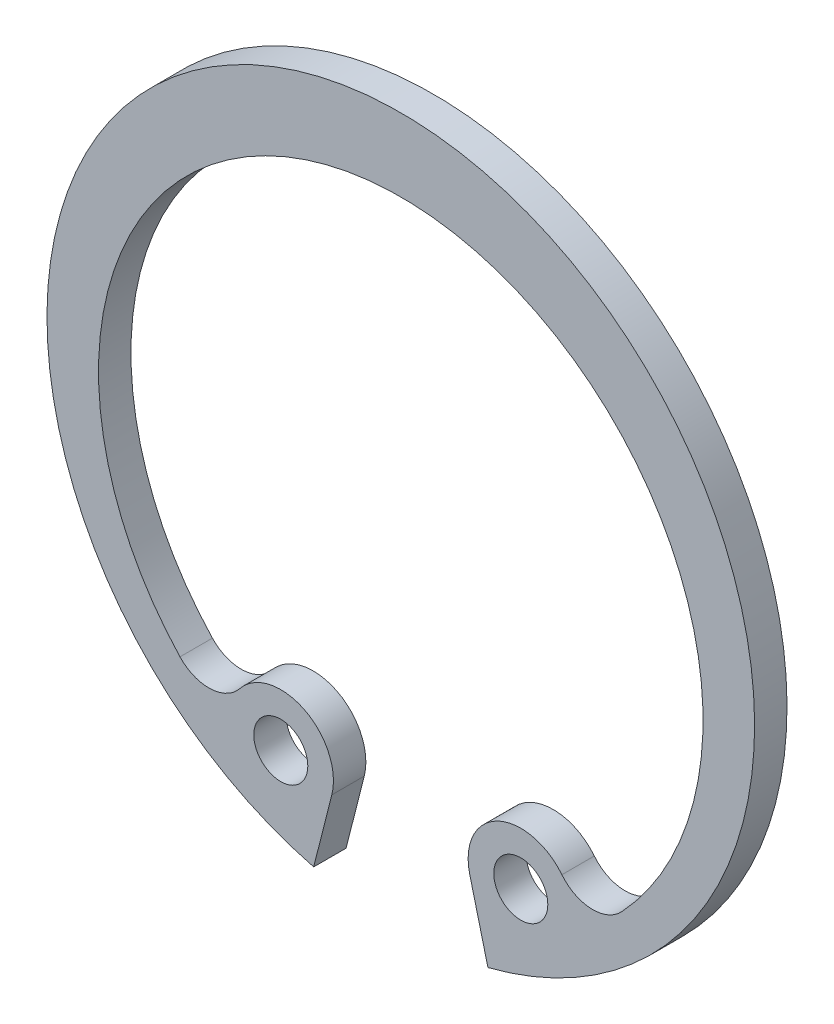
ISO-10303-21;
HEADER;
FILE_DESCRIPTION(('STEP AP214'),'2;1');
FILE_NAME('part.step','',(''),(''),'','','');
FILE_SCHEMA(('AUTOMOTIVE_DESIGN { 1 0 10303 214 1 1 1 1 }'));
ENDSEC;
DATA;
#1=APPLICATION_CONTEXT('core data for automotive mechanical design processes');
#2=APPLICATION_PROTOCOL_DEFINITION('international standard','automotive_design',2000,#1);
#3=PRODUCT_CONTEXT('',#1,'mechanical');
#4=PRODUCT('Part','Part','',(#3));
#5=PRODUCT_RELATED_PRODUCT_CATEGORY('part','',(#4));
#6=PRODUCT_DEFINITION_FORMATION('','',#4);
#7=PRODUCT_DEFINITION_CONTEXT('part definition',#1,'design');
#8=PRODUCT_DEFINITION('design','',#6,#7);
#9=PRODUCT_DEFINITION_SHAPE('','',#8);
#10=(LENGTH_UNIT() NAMED_UNIT(*) SI_UNIT(.MILLI.,.METRE.));
#11=(NAMED_UNIT(*) PLANE_ANGLE_UNIT() SI_UNIT($,.RADIAN.));
#12=(NAMED_UNIT(*) SI_UNIT($,.STERADIAN.) SOLID_ANGLE_UNIT());
#13=UNCERTAINTY_MEASURE_WITH_UNIT(LENGTH_MEASURE(1.E-05),#10,'distance_accuracy_value','');
#14=(GEOMETRIC_REPRESENTATION_CONTEXT(3) GLOBAL_UNCERTAINTY_ASSIGNED_CONTEXT((#13)) GLOBAL_UNIT_ASSIGNED_CONTEXT((#10,
#11,#12)) REPRESENTATION_CONTEXT('',''));
#15=CARTESIAN_POINT('',(0.,0.,0.));
#16=DIRECTION('',(0.,0.,1.));
#17=DIRECTION('',(1.,0.,0.));
#18=AXIS2_PLACEMENT_3D('',#15,#16,#17);
#19=CARTESIAN_POINT('',(0.,0.,-1.2));
#20=DIRECTION('',(0.,0.,1.));
#21=DIRECTION('',(1.,0.,0.));
#22=AXIS2_PLACEMENT_3D('',#19,#20,#21);
#23=CYLINDRICAL_SURFACE('',#22,13.1);
#24=CARTESIAN_POINT('',(0.,0.,0.));
#25=DIRECTION('',(0.,0.,1.));
#26=DIRECTION('',(1.,0.,0.));
#27=AXIS2_PLACEMENT_3D('',#24,#25,#26);
#28=CIRCLE('',#27,13.1);
#29=CARTESIAN_POINT('',(3.22587684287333,-12.6966026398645,0.));
#30=VERTEX_POINT('',#29);
#31=CARTESIAN_POINT('',(-3.22587684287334,-12.6966026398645,0.));
#32=VERTEX_POINT('',#31);
#33=EDGE_CURVE('E130',#30,#32,#28,.T.);
#34=ORIENTED_EDGE('',*,*,#33,.F.);
#35=DIRECTION('',(0.,0.,1.));
#36=VECTOR('',#35,1.);
#37=CARTESIAN_POINT('',(3.22587684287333,-12.6966026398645,-1.2));
#38=LINE('',#37,#36);
#39=CARTESIAN_POINT('',(3.22587684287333,-12.6966026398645,-1.2));
#40=VERTEX_POINT('',#39);
#41=EDGE_CURVE('E11',#40,#30,#38,.T.);
#42=ORIENTED_EDGE('',*,*,#41,.F.);
#43=CARTESIAN_POINT('',(0.,0.,-1.2));
#44=DIRECTION('',(0.,0.,1.));
#45=DIRECTION('',(1.,0.,0.));
#46=AXIS2_PLACEMENT_3D('',#43,#44,#45);
#47=CIRCLE('',#46,13.1);
#48=CARTESIAN_POINT('',(-3.22587684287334,-12.6966026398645,-1.2));
#49=VERTEX_POINT('',#48);
#50=EDGE_CURVE('E151',#40,#49,#47,.T.);
#51=ORIENTED_EDGE('',*,*,#50,.T.);
#52=DIRECTION('',(0.,0.,1.));
#53=VECTOR('',#52,1.);
#54=CARTESIAN_POINT('',(-3.22587684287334,-12.6966026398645,-1.2));
#55=LINE('',#54,#53);
#56=EDGE_CURVE('E36',#49,#32,#55,.T.);
#57=ORIENTED_EDGE('',*,*,#56,.T.);
#58=EDGE_LOOP('',(#34,#42,#51,#57));
#59=FACE_BOUND('',#58,.T.);
#60=ADVANCED_FACE('F33',(#59),#23,.T.);
#61=CARTESIAN_POINT('',(3.22587684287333,-12.6966026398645,-1.2));
#62=DIRECTION('',(-0.969206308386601,-0.246250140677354,0.));
#63=DIRECTION('',(0.246250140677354,-0.969206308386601,0.));
#64=AXIS2_PLACEMENT_3D('',#61,#62,#63);
#65=PLANE('',#64);
#66=DIRECTION('',(0.246250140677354,-0.969206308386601,0.));
#67=VECTOR('',#66,1.);
#68=CARTESIAN_POINT('',(3.22587684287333,-12.6966026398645,0.));
#69=LINE('',#68,#67);
#70=CARTESIAN_POINT('',(2.55317580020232,-10.048944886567,0.));
#71=VERTEX_POINT('',#70);
#72=EDGE_CURVE('E149',#71,#30,#69,.T.);
#73=ORIENTED_EDGE('',*,*,#72,.F.);
#74=DIRECTION('',(0.,0.,1.));
#75=VECTOR('',#74,1.);
#76=CARTESIAN_POINT('',(2.55317580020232,-10.048944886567,-1.2));
#77=LINE('',#76,#75);
#78=CARTESIAN_POINT('',(2.55317580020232,-10.048944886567,-1.2));
#79=VERTEX_POINT('',#78);
#80=EDGE_CURVE('E42',#79,#71,#77,.T.);
#81=ORIENTED_EDGE('',*,*,#80,.F.);
#82=DIRECTION('',(0.246250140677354,-0.969206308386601,0.));
#83=VECTOR('',#82,1.);
#84=CARTESIAN_POINT('',(3.22587684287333,-12.6966026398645,-1.2));
#85=LINE('',#84,#83);
#86=EDGE_CURVE('E120',#79,#40,#85,.T.);
#87=ORIENTED_EDGE('',*,*,#86,.T.);
#88=ORIENTED_EDGE('',*,*,#41,.T.);
#89=EDGE_LOOP('',(#73,#81,#87,#88));
#90=FACE_BOUND('',#89,.T.);
#91=ADVANCED_FACE('F163',(#90),#65,.T.);
#92=CARTESIAN_POINT('',(4.4431281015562,-9.56875711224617,-1.2));
#93=DIRECTION('',(0.,0.,1.));
#94=DIRECTION('',(1.,0.,0.));
#95=AXIS2_PLACEMENT_3D('',#92,#93,#94);
#96=CYLINDRICAL_SURFACE('',#95,1.95);
#97=CARTESIAN_POINT('',(4.4431281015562,-9.56875711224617,0.));
#98=DIRECTION('',(0.,0.,1.));
#99=DIRECTION('',(1.,0.,0.));
#100=AXIS2_PLACEMENT_3D('',#97,#98,#99);
#101=CIRCLE('',#100,1.95);
#102=CARTESIAN_POINT('',(5.96514420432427,-8.34975465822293,0.));
#103=VERTEX_POINT('',#102);
#104=EDGE_CURVE('E107',#103,#71,#101,.T.);
#105=ORIENTED_EDGE('',*,*,#104,.F.);
#106=DIRECTION('',(0.,0.,1.));
#107=VECTOR('',#106,1.);
#108=CARTESIAN_POINT('',(5.96514420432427,-8.34975465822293,-1.2));
#109=LINE('',#108,#107);
#110=CARTESIAN_POINT('',(5.96514420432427,-8.34975465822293,-1.2));
#111=VERTEX_POINT('',#110);
#112=EDGE_CURVE('E102',#111,#103,#109,.T.);
#113=ORIENTED_EDGE('',*,*,#112,.F.);
#114=CARTESIAN_POINT('',(4.4431281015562,-9.56875711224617,-1.2));
#115=DIRECTION('',(0.,0.,1.));
#116=DIRECTION('',(1.,0.,0.));
#117=AXIS2_PLACEMENT_3D('',#114,#115,#116);
#118=CIRCLE('',#117,1.95);
#119=EDGE_CURVE('E105',#111,#79,#118,.T.);
#120=ORIENTED_EDGE('',*,*,#119,.T.);
#121=ORIENTED_EDGE('',*,*,#80,.T.);
#122=EDGE_LOOP('',(#105,#113,#120,#121));
#123=FACE_BOUND('',#122,.T.);
#124=ADVANCED_FACE('F104',(#123),#96,.T.);
#125=CARTESIAN_POINT('',(7.10665628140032,-7.4355028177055,-1.2));
#126=DIRECTION('',(0.,0.,1.));
#127=DIRECTION('',(1.,0.,0.));
#128=AXIS2_PLACEMENT_3D('',#125,#126,#127);
#129=CYLINDRICAL_SURFACE('',#128,1.4625);
#130=CARTESIAN_POINT('',(7.10665628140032,-7.4355028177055,0.));
#131=DIRECTION('',(0.,0.,-1.));
#132=DIRECTION('',(1.,0.,0.));
#133=AXIS2_PLACEMENT_3D('',#130,#131,#132);
#134=CIRCLE('',#133,1.4625);
#135=CARTESIAN_POINT('',(8.17497614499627,-8.43430155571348,0.));
#136=VERTEX_POINT('',#135);
#137=EDGE_CURVE('E146',#136,#103,#134,.T.);
#138=ORIENTED_EDGE('',*,*,#137,.F.);
#139=DIRECTION('',(0.,0.,1.));
#140=VECTOR('',#139,1.);
#141=CARTESIAN_POINT('',(8.17497614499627,-8.43430155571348,-1.2));
#142=LINE('',#141,#140);
#143=CARTESIAN_POINT('',(8.17497614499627,-8.43430155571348,-1.2));
#144=VERTEX_POINT('',#143);
#145=EDGE_CURVE('E112',#144,#136,#142,.T.);
#146=ORIENTED_EDGE('',*,*,#145,.F.);
#147=CARTESIAN_POINT('',(7.10665628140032,-7.4355028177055,-1.2));
#148=DIRECTION('',(0.,0.,-1.));
#149=DIRECTION('',(1.,0.,0.));
#150=AXIS2_PLACEMENT_3D('',#147,#148,#149);
#151=CIRCLE('',#150,1.4625);
#152=EDGE_CURVE('E118',#144,#111,#151,.T.);
#153=ORIENTED_EDGE('',*,*,#152,.T.);
#154=ORIENTED_EDGE('',*,*,#112,.T.);
#155=EDGE_LOOP('',(#138,#146,#153,#154));
#156=FACE_BOUND('',#155,.T.);
#157=ADVANCED_FACE('F122',(#156),#129,.F.);
#158=CARTESIAN_POINT('',(0.,-0.791313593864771,-1.2));
#159=DIRECTION('',(0.,0.,1.));
#160=DIRECTION('',(1.,0.,0.));
#161=AXIS2_PLACEMENT_3D('',#158,#159,#160);
#162=CYLINDRICAL_SURFACE('',#161,11.1913135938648);
#163=CARTESIAN_POINT('',(0.,-0.791313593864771,0.));
#164=DIRECTION('',(0.,0.,-1.));
#165=DIRECTION('',(1.,0.,0.));
#166=AXIS2_PLACEMENT_3D('',#163,#164,#165);
#167=CIRCLE('',#166,11.1913135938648);
#168=CARTESIAN_POINT('',(-8.17497614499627,-8.43430155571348,0.));
#169=VERTEX_POINT('',#168);
#170=EDGE_CURVE('E143',#169,#136,#167,.T.);
#171=ORIENTED_EDGE('',*,*,#170,.F.);
#172=DIRECTION('',(0.,0.,1.));
#173=VECTOR('',#172,1.);
#174=CARTESIAN_POINT('',(-8.17497614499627,-8.43430155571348,-1.2));
#175=LINE('',#174,#173);
#176=CARTESIAN_POINT('',(-8.17497614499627,-8.43430155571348,-1.2));
#177=VERTEX_POINT('',#176);
#178=EDGE_CURVE('E155',#177,#169,#175,.T.);
#179=ORIENTED_EDGE('',*,*,#178,.F.);
#180=CARTESIAN_POINT('',(0.,-0.791313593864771,-1.2));
#181=DIRECTION('',(0.,0.,-1.));
#182=DIRECTION('',(1.,0.,0.));
#183=AXIS2_PLACEMENT_3D('',#180,#181,#182);
#184=CIRCLE('',#183,11.1913135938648);
#185=EDGE_CURVE('E123',#177,#144,#184,.T.);
#186=ORIENTED_EDGE('',*,*,#185,.T.);
#187=ORIENTED_EDGE('',*,*,#145,.T.);
#188=EDGE_LOOP('',(#171,#179,#186,#187));
#189=FACE_BOUND('',#188,.T.);
#190=ADVANCED_FACE('F176',(#189),#162,.F.);
#191=CARTESIAN_POINT('',(-7.10665628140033,-7.4355028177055,-1.2));
#192=DIRECTION('',(0.,0.,1.));
#193=DIRECTION('',(1.,0.,0.));
#194=AXIS2_PLACEMENT_3D('',#191,#192,#193);
#195=CYLINDRICAL_SURFACE('',#194,1.4625);
#196=CARTESIAN_POINT('',(-7.10665628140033,-7.4355028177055,0.));
#197=DIRECTION('',(0.,0.,-1.));
#198=DIRECTION('',(1.,0.,0.));
#199=AXIS2_PLACEMENT_3D('',#196,#197,#198);
#200=CIRCLE('',#199,1.4625);
#201=CARTESIAN_POINT('',(-5.96514420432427,-8.34975465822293,0.));
#202=VERTEX_POINT('',#201);
#203=EDGE_CURVE('E140',#202,#169,#200,.T.);
#204=ORIENTED_EDGE('',*,*,#203,.F.);
#205=DIRECTION('',(0.,0.,1.));
#206=VECTOR('',#205,1.);
#207=CARTESIAN_POINT('',(-5.96514420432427,-8.34975465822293,-1.2));
#208=LINE('',#207,#206);
#209=CARTESIAN_POINT('',(-5.96514420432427,-8.34975465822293,-1.2));
#210=VERTEX_POINT('',#209);
#211=EDGE_CURVE('E157',#210,#202,#208,.T.);
#212=ORIENTED_EDGE('',*,*,#211,.F.);
#213=CARTESIAN_POINT('',(-7.10665628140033,-7.4355028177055,-1.2));
#214=DIRECTION('',(0.,0.,-1.));
#215=DIRECTION('',(1.,0.,0.));
#216=AXIS2_PLACEMENT_3D('',#213,#214,#215);
#217=CIRCLE('',#216,1.4625);
#218=EDGE_CURVE('E125',#210,#177,#217,.T.);
#219=ORIENTED_EDGE('',*,*,#218,.T.);
#220=ORIENTED_EDGE('',*,*,#178,.T.);
#221=EDGE_LOOP('',(#204,#212,#219,#220));
#222=FACE_BOUND('',#221,.T.);
#223=ADVANCED_FACE('F179',(#222),#195,.F.);
#224=CARTESIAN_POINT('',(-4.4431281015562,-9.56875711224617,-1.2));
#225=DIRECTION('',(0.,0.,1.));
#226=DIRECTION('',(1.,0.,0.));
#227=AXIS2_PLACEMENT_3D('',#224,#225,#226);
#228=CYLINDRICAL_SURFACE('',#227,1.95);
#229=CARTESIAN_POINT('',(-4.4431281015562,-9.56875711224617,0.));
#230=DIRECTION('',(0.,0.,1.));
#231=DIRECTION('',(1.,0.,0.));
#232=AXIS2_PLACEMENT_3D('',#229,#230,#231);
#233=CIRCLE('',#232,1.95);
#234=CARTESIAN_POINT('',(-2.55317580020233,-10.048944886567,0.));
#235=VERTEX_POINT('',#234);
#236=EDGE_CURVE('E137',#235,#202,#233,.T.);
#237=ORIENTED_EDGE('',*,*,#236,.F.);
#238=DIRECTION('',(0.,0.,1.));
#239=VECTOR('',#238,1.);
#240=CARTESIAN_POINT('',(-2.55317580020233,-10.048944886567,-1.2));
#241=LINE('',#240,#239);
#242=CARTESIAN_POINT('',(-2.55317580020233,-10.048944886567,-1.2));
#243=VERTEX_POINT('',#242);
#244=EDGE_CURVE('E158',#243,#235,#241,.T.);
#245=ORIENTED_EDGE('',*,*,#244,.F.);
#246=CARTESIAN_POINT('',(-4.4431281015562,-9.56875711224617,-1.2));
#247=DIRECTION('',(0.,0.,1.));
#248=DIRECTION('',(1.,0.,0.));
#249=AXIS2_PLACEMENT_3D('',#246,#247,#248);
#250=CIRCLE('',#249,1.95);
#251=EDGE_CURVE('E225',#243,#210,#250,.T.);
#252=ORIENTED_EDGE('',*,*,#251,.T.);
#253=ORIENTED_EDGE('',*,*,#211,.T.);
#254=EDGE_LOOP('',(#237,#245,#252,#253));
#255=FACE_BOUND('',#254,.T.);
#256=ADVANCED_FACE('F183',(#255),#228,.T.);
#257=CARTESIAN_POINT('',(-3.22587684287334,-12.6966026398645,-1.2));
#258=DIRECTION('',(0.969206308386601,-0.246250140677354,0.));
#259=DIRECTION('',(0.246250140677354,0.969206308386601,0.));
#260=AXIS2_PLACEMENT_3D('',#257,#258,#259);
#261=PLANE('',#260);
#262=DIRECTION('',(0.246250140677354,0.969206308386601,0.));
#263=VECTOR('',#262,1.);
#264=CARTESIAN_POINT('',(-3.22587684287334,-12.6966026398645,0.));
#265=LINE('',#264,#263);
#266=EDGE_CURVE('E133',#32,#235,#265,.T.);
#267=ORIENTED_EDGE('',*,*,#266,.F.);
#268=ORIENTED_EDGE('',*,*,#56,.F.);
#269=DIRECTION('',(0.246250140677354,0.969206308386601,0.));
#270=VECTOR('',#269,1.);
#271=CARTESIAN_POINT('',(-3.22587684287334,-12.6966026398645,-1.2));
#272=LINE('',#271,#270);
#273=EDGE_CURVE('E223',#49,#243,#272,.T.);
#274=ORIENTED_EDGE('',*,*,#273,.T.);
#275=ORIENTED_EDGE('',*,*,#244,.T.);
#276=EDGE_LOOP('',(#267,#268,#274,#275));
#277=FACE_BOUND('',#276,.T.);
#278=ADVANCED_FACE('F160',(#277),#261,.T.);
#279=CARTESIAN_POINT('',(0.,0.,-1.2));
#280=DIRECTION('',(0.,0.,1.));
#281=DIRECTION('',(1.,0.,0.));
#282=AXIS2_PLACEMENT_3D('',#279,#280,#281);
#283=PLANE('',#282);
#284=CARTESIAN_POINT('',(-4.4431281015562,-9.56875711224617,-1.2));
#285=DIRECTION('',(0.,0.,1.));
#286=DIRECTION('',(1.,0.,0.));
#287=AXIS2_PLACEMENT_3D('',#284,#285,#286);
#288=CIRCLE('',#287,1.);
#289=CARTESIAN_POINT('',(-3.4431281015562,-9.56875711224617,-1.2));
#290=VERTEX_POINT('',#289);
#291=EDGE_CURVE('E210',#290,#290,#288,.T.);
#292=ORIENTED_EDGE('',*,*,#291,.T.);
#293=EDGE_LOOP('',(#292));
#294=FACE_BOUND('',#293,.T.);
#295=CARTESIAN_POINT('',(4.4431281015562,-9.56875711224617,-1.2));
#296=DIRECTION('',(0.,0.,1.));
#297=DIRECTION('',(1.,0.,0.));
#298=AXIS2_PLACEMENT_3D('',#295,#296,#297);
#299=CIRCLE('',#298,1.);
#300=CARTESIAN_POINT('',(5.4431281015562,-9.56875711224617,-1.2));
#301=VERTEX_POINT('',#300);
#302=EDGE_CURVE('E134',#301,#301,#299,.T.);
#303=ORIENTED_EDGE('',*,*,#302,.T.);
#304=EDGE_LOOP('',(#303));
#305=FACE_BOUND('',#304,.T.);
#306=ORIENTED_EDGE('',*,*,#50,.F.);
#307=ORIENTED_EDGE('',*,*,#86,.F.);
#308=ORIENTED_EDGE('',*,*,#119,.F.);
#309=ORIENTED_EDGE('',*,*,#152,.F.);
#310=ORIENTED_EDGE('',*,*,#185,.F.);
#311=ORIENTED_EDGE('',*,*,#218,.F.);
#312=ORIENTED_EDGE('',*,*,#251,.F.);
#313=ORIENTED_EDGE('',*,*,#273,.F.);
#314=EDGE_LOOP('',(#306,#307,#308,#309,#310,#311,#312,#313));
#315=FACE_BOUND('',#314,.T.);
#316=ADVANCED_FACE('F116',(#294,#305,#315),#283,.F.);
#317=CARTESIAN_POINT('',(0.,0.,0.));
#318=DIRECTION('',(0.,0.,1.));
#319=DIRECTION('',(1.,0.,0.));
#320=AXIS2_PLACEMENT_3D('',#317,#318,#319);
#321=PLANE('',#320);
#322=CARTESIAN_POINT('',(-4.4431281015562,-9.56875711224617,0.));
#323=DIRECTION('',(0.,0.,1.));
#324=DIRECTION('',(1.,0.,0.));
#325=AXIS2_PLACEMENT_3D('',#322,#323,#324);
#326=CIRCLE('',#325,1.);
#327=CARTESIAN_POINT('',(-3.4431281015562,-9.56875711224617,0.));
#328=VERTEX_POINT('',#327);
#329=EDGE_CURVE('E213',#328,#328,#326,.T.);
#330=ORIENTED_EDGE('',*,*,#329,.F.);
#331=EDGE_LOOP('',(#330));
#332=FACE_BOUND('',#331,.T.);
#333=CARTESIAN_POINT('',(4.4431281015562,-9.56875711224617,0.));
#334=DIRECTION('',(0.,0.,1.));
#335=DIRECTION('',(1.,0.,0.));
#336=AXIS2_PLACEMENT_3D('',#333,#334,#335);
#337=CIRCLE('',#336,1.);
#338=CARTESIAN_POINT('',(5.4431281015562,-9.56875711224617,0.));
#339=VERTEX_POINT('',#338);
#340=EDGE_CURVE('E215',#339,#339,#337,.T.);
#341=ORIENTED_EDGE('',*,*,#340,.F.);
#342=EDGE_LOOP('',(#341));
#343=FACE_BOUND('',#342,.T.);
#344=ORIENTED_EDGE('',*,*,#33,.T.);
#345=ORIENTED_EDGE('',*,*,#266,.T.);
#346=ORIENTED_EDGE('',*,*,#236,.T.);
#347=ORIENTED_EDGE('',*,*,#203,.T.);
#348=ORIENTED_EDGE('',*,*,#170,.T.);
#349=ORIENTED_EDGE('',*,*,#137,.T.);
#350=ORIENTED_EDGE('',*,*,#104,.T.);
#351=ORIENTED_EDGE('',*,*,#72,.T.);
#352=EDGE_LOOP('',(#344,#345,#346,#347,#348,#349,#350,#351));
#353=FACE_BOUND('',#352,.T.);
#354=ADVANCED_FACE('F162',(#332,#343,#353),#321,.T.);
#355=CARTESIAN_POINT('',(4.4431281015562,-9.56875711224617,-1.2));
#356=DIRECTION('',(0.,0.,1.));
#357=DIRECTION('',(1.,0.,0.));
#358=AXIS2_PLACEMENT_3D('',#355,#356,#357);
#359=CYLINDRICAL_SURFACE('',#358,1.);
#360=ORIENTED_EDGE('',*,*,#302,.F.);
#361=EDGE_LOOP('',(#360));
#362=FACE_BOUND('',#361,.T.);
#363=ORIENTED_EDGE('',*,*,#340,.T.);
#364=EDGE_LOOP('',(#363));
#365=FACE_BOUND('',#364,.T.);
#366=ADVANCED_FACE('F195',(#362,#365),#359,.F.);
#367=CARTESIAN_POINT('',(-4.4431281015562,-9.56875711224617,-1.2));
#368=DIRECTION('',(0.,0.,1.));
#369=DIRECTION('',(1.,0.,0.));
#370=AXIS2_PLACEMENT_3D('',#367,#368,#369);
#371=CYLINDRICAL_SURFACE('',#370,1.);
#372=ORIENTED_EDGE('',*,*,#291,.F.);
#373=EDGE_LOOP('',(#372));
#374=FACE_BOUND('',#373,.T.);
#375=ORIENTED_EDGE('',*,*,#329,.T.);
#376=EDGE_LOOP('',(#375));
#377=FACE_BOUND('',#376,.T.);
#378=ADVANCED_FACE('F202',(#374,#377),#371,.F.);
#379=CLOSED_SHELL('',(#60,#91,#124,#157,#190,#223,#256,#278,#316,#354,#366,#378));
#380=MANIFOLD_SOLID_BREP('B2',#379);
#381=ADVANCED_BREP_SHAPE_REPRESENTATION('',(#18,#380),#14);
#382=SHAPE_DEFINITION_REPRESENTATION(#9,#381);
ENDSEC;
END-ISO-10303-21;
